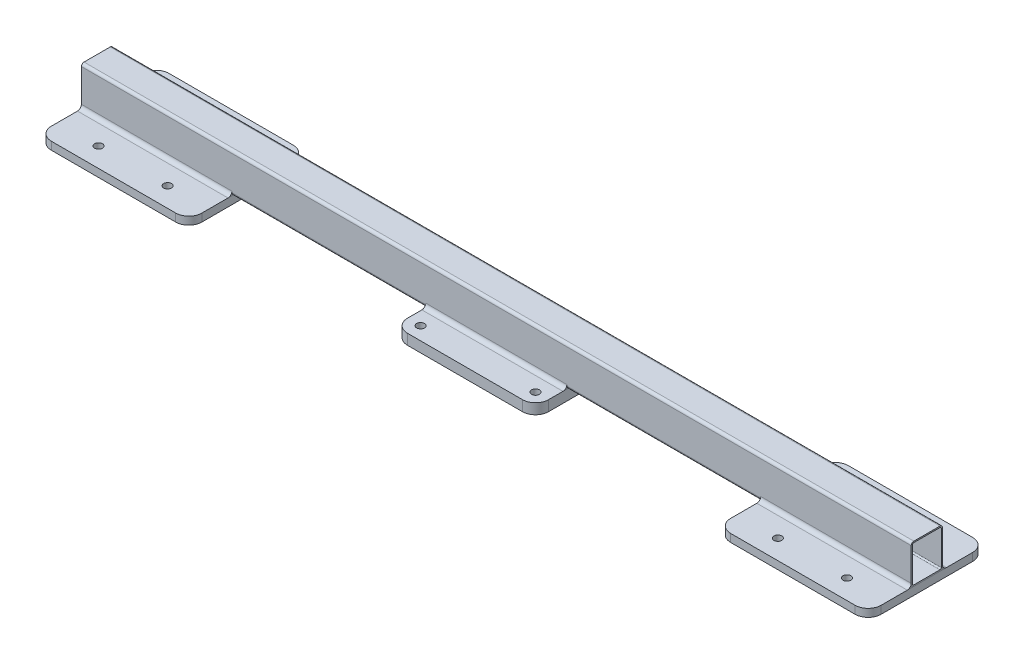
from build123d import *

# Parameters (mm, degrees)
SKETCH2_W                           = 1588
SKETCH2_H                           = 60
EXTRUDE1_DEPTH                      = 75
FILLET1_R                           = 5
SHELL1_T                            = -2.5
SKETCH2_3_R                         = 7.5
SKETCH2_3_W                         = 288
SKETCH2_3_H                         = 60
EXTRUDE2_DEPTH                      = 15
SKETCH2_4_W                         = 270
SKETCH2_4_H                         = 180
EXTRUDE3_DEPTH                      = 20
EXTRUDE4_DEPTH                      = 288
EXTRUDE5_REACH                      = 807.43
EXTRUDE5_DIRECTION_2_REACH          = 807.43
FILLET9_R                           = 2
FILLET10_R                          = 2
FILLET11_R                          = 25
SKETCH7_W                           = 7.5
SKETCH7_H                           = 20
F_15_0_15_DIAMETER_HOLE1_AT_2_COUNT = 2
F_15_0_15_DIAMETER_HOLE1_AT_2_PITCH = 130
F_15_0_15_DIAMETER_HOLE1_AT_3_COUNT = 2
F_15_0_15_DIAMETER_HOLE1_AT_3_PITCH = 255.538646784
F_15_0_15_DIAMETER_HOLE1_AT_4_COUNT = 2
F_15_0_15_DIAMETER_HOLE1_AT_4_PITCH = 220


with BuildPart() as part:
    # Sketch2 → Extrude1 (new body)
    with BuildSketch(Plane(origin=(0, 0, 0), x_dir=(1, 0, 0), z_dir=(0, 1, 0))):
        Rectangle(SKETCH2_W, SKETCH2_H)
    extrude(amount=EXTRUDE1_DEPTH)

    # Fillet1
    fillet1_edges = [part.edges().sort_by_distance(p)[0] for p in [
        (0, 75, -30),
        (0, 75, 30),
        (0, 0, -30),
        (0, 0, 30),
    ]]
    fillet(fillet1_edges, radius=FILLET1_R)

    # Shell1
    shell1_openings = [part.faces().sort_by_distance(p)[0] for p in [
        (-794, 37.5, 0),
        (794, 37.5, 0),
    ]]
    offset(amount=SHELL1_T, openings=shell1_openings, kind=Kind.INTERSECTION)


with BuildPart() as body_2:
    # Sketch2_3 → Extrude2 (new body)
    # profile 1 of 6: a face of its own
    with BuildSketch(Plane(origin=(0, 0, 0), x_dir=(1, 0, 0), z_dir=(0, 1, 0))):
        with BuildLine():
            Line((-794, 30), (-506, 30))
            Line((-506, 30), (-506, 87.5))
            ThreePointArc((-506, 87.5), (-513.32233047, 105.17766953), (-531, 112.5))
            Line((-531, 112.5), (-769, 112.5))
            ThreePointArc((-769, 112.5), (-786.67766953, 105.17766953), (-794, 87.5))
            Line((-794, 87.5), (-794, 30))
        make_face()
        with Locations(Location((-715.998314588, 75.128040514, 0), (0, 0, 270))):
            Circle(SKETCH2_3_R, mode=Mode.SUBTRACT)
        with Locations(Location((-584.001685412, 75.128040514, 0), (0, 0, 270))):
            Circle(SKETCH2_3_R, mode=Mode.SUBTRACT)
    # profile 2 of 6: a face of its own
    with BuildSketch(Plane(origin=(0, 0, 0), x_dir=(1, 0, 0), z_dir=(0, 1, 0))):
        with Locations((-650, 0)):
            Rectangle(SKETCH2_3_W, SKETCH2_3_H)
    # profile 3 of 6: a face of its own
    with BuildSketch(Plane(origin=(0, 0, 0), x_dir=(1, 0, 0), z_dir=(0, 1, 0))):
        with BuildLine():
            Line((-506, -87.5), (-506, -30))
            Line((-506, -30), (-794, -30))
            Line((-794, -30), (-794, -87.5))
            ThreePointArc((-794, -87.5), (-786.67766953, -105.17766953), (-769, -112.5))
            Line((-769, -112.5), (-531, -112.5))
            ThreePointArc((-531, -112.5), (-513.32233047, -105.17766953), (-506, -87.5))
        make_face()
        with Locations(Location((-715.998314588, -75.128040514, 0), (0, 0, 270))):
            Circle(SKETCH2_3_R, mode=Mode.SUBTRACT)
        with Locations(Location((-584.001685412, -75.128040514, 0), (0, 0, 270))):
            Circle(SKETCH2_3_R, mode=Mode.SUBTRACT)
    # profile 4 of 6: a face of its own
    with BuildSketch(Plane(origin=(0, 0, 0), x_dir=(1, 0, 0), z_dir=(0, 1, 0))):
        with BuildLine():
            Line((506, 87.5), (506, 30))
            Line((506, 30), (794, 30))
            Line((794, 30), (794, 87.5))
            ThreePointArc((794, 87.5), (786.67766953, 105.17766953), (769, 112.5))
            Line((769, 112.5), (531, 112.5))
            ThreePointArc((531, 112.5), (513.32233047, 105.17766953), (506, 87.5))
        make_face()
        with Locations(Location((584.001685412, 75.128040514, 0), (0, 0, 270))):
            Circle(SKETCH2_3_R, mode=Mode.SUBTRACT)
        with Locations(Location((715.998314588, 75.128040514, 0), (0, 0, 270))):
            Circle(SKETCH2_3_R, mode=Mode.SUBTRACT)
    # profile 5 of 6: a face of its own
    with BuildSketch(Plane(origin=(0, 0, 0), x_dir=(1, 0, 0), z_dir=(0, 1, 0))):
        with Locations((650, 0)):
            Rectangle(SKETCH2_3_W, SKETCH2_3_H)
    # profile 6 of 6: a face of its own
    with BuildSketch(Plane(origin=(0, 0, 0), x_dir=(1, 0, 0), z_dir=(0, 1, 0))):
        with BuildLine():
            ThreePointArc((506, -87.5), (513.32233047, -105.17766953), (531, -112.5))
            Line((531, -112.5), (769, -112.5))
            ThreePointArc((769, -112.5), (786.67766953, -105.17766953), (794, -87.5))
            Line((794, -87.5), (794, -30))
            Line((794, -30), (506, -30))
            Line((506, -30), (506, -87.5))
        make_face()
        with Locations(Location((584.001685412, -75.128040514, 0), (0, 0, 270))):
            Circle(SKETCH2_3_R, mode=Mode.SUBTRACT)
        with Locations(Location((715.998314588, -75.128040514, 0), (0, 0, 270))):
            Circle(SKETCH2_3_R, mode=Mode.SUBTRACT)
    extrude(amount=-EXTRUDE2_DEPTH)

    # Fillet9
    fillet9_edges = [body_2.edges().sort_by_distance(p)[0] for p in [
        (-584.001685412, -15, -82.628040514),
        (-715.998314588, -15, -82.628040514),
        (-715.998314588, -15, 67.628040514),
        (-584.001685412, -15, 67.628040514),
    ]]
    fillet(fillet9_edges, radius=FILLET9_R)

    # Fillet10
    fillet10_edges = [body_2.edges().sort_by_distance(p)[0] for p in [
        (584.001685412, -15, -82.628040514),
        (715.998314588, -15, -82.628040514),
        (584.001685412, -15, 67.628040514),
        (715.998314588, -15, 67.628040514),
    ]]
    fillet(fillet10_edges, radius=FILLET10_R)


with BuildPart() as body_3:
    # Sketch2_4 → Extrude3 (new body)
    with BuildSketch(Plane(origin=(0, 0, 0), x_dir=(1, 0, 0), z_dir=(0, 1, 0))):
        Rectangle(SKETCH2_4_W, SKETCH2_4_H)
    extrude(amount=-EXTRUDE3_DEPTH)


with BuildPart() as body_4:
    # Sketch3 → Extrude4 (new body)
    with BuildSketch(Plane(origin=(794, 0, 0), x_dir=(0, 0, -1), z_dir=(1, 0, 0))):
        with BuildLine():
            Line((25, 0), (37.5, 0))
            ThreePointArc((37.5, 0), (32.196699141, 2.196699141), (30, 7.5))
            Line((30, 7.5), (30, 5))
            ThreePointArc((30, 5), (28.535533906, 1.464466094), (25, 0))
        make_face()
    extrude(amount=-EXTRUDE4_DEPTH)


with BuildPart() as body_5:
    # Mirror3: mirrored copy
    add(body_4.part.mirror(Plane.XY))


with BuildPart() as body_6:
    # Mirror4: mirrored copy
    add(body_4.part.mirror(Plane(origin=(0, 0, 0), x_dir=(0, 0, 1), z_dir=(1, 0, 0))))


with BuildPart() as body_7:
    # Mirror4 2: mirrored copy
    add(body_5.part.mirror(Plane(origin=(0, 0, 0), x_dir=(0, 0, 1), z_dir=(1, 0, 0))))


with BuildPart() as body_8:

    # Extrude5: up to this face of the body (flat: up to its plane)
    extrude5_end = Plane(body_3.part.faces().sort_by_distance((135, -10, 0))[0])
    # Sketch4 → Extrude5 (new, up to the picked face)
    with BuildSketch(Plane(origin=(0, 0, 0), x_dir=(0, 0, -1), z_dir=(1, 0, 0)), mode=Mode.PRIVATE) as extrude5_sk1:
        with BuildLine():
            Line((25, 0), (37.5, 0))
            ThreePointArc((37.5, 0), (32.196699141, 2.196699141), (30, 7.5))
            Line((30, 7.5), (30, 5))
            ThreePointArc((30, 5), (28.535533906, 1.464466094), (25, 0))
        make_face()
    extrude5_tool1 = split(extrude(extrude5_sk1.sketch, amount=EXTRUDE5_REACH, mode=Mode.PRIVATE), bisect_by=extrude5_end, keep=Keep.BOTH, mode=Mode.PRIVATE)
    add(extrude5_tool1.solids().sort_by(Axis((0, 1.503438, -30.816152), (1, 0, 0)))[0])


    # Extrude5 direction 2: up to this face of the body (flat: up to its plane)
    extrude5_direction_2_end = Plane(body_3.part.faces().sort_by_distance((-135, -10, 0))[0])
    # Sketch4 → Extrude5 direction 2 (add, up to the picked face)
    with BuildSketch(Plane(origin=(0, 0, 0), x_dir=(0, 0, -1), z_dir=(1, 0, 0)), mode=Mode.PRIVATE) as extrude5_direction_2_sk1:
        with BuildLine():
            Line((25, 0), (37.5, 0))
            ThreePointArc((37.5, 0), (32.196699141, 2.196699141), (30, 7.5))
            Line((30, 7.5), (30, 5))
            ThreePointArc((30, 5), (28.535533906, 1.464466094), (25, 0))
        make_face()
    extrude5_direction_2_tool1 = split(extrude(extrude5_direction_2_sk1.sketch, amount=-EXTRUDE5_DIRECTION_2_REACH, mode=Mode.PRIVATE), bisect_by=extrude5_direction_2_end, keep=Keep.BOTH, mode=Mode.PRIVATE)
    add(extrude5_direction_2_tool1.solids().sort_by(Axis((0, 1.503438, -30.816152), (-1, 0, 0)))[0])


with BuildPart() as body_9:
    # Mirror5: mirrored copy
    add(body_8.part.mirror(Plane.XY))


with BuildPart() as body_3_1:
    add(body_3.part)

    # Fillet11
    fillet11_edges = [body_3_1.edges().sort_by_distance(p)[0] for p in [
        (-135, -10, -90),
        (135, -10, -90),
        (135, -10, 90),
        (-135, -10, 90),
    ]]
    fillet(fillet11_edges, radius=FILLET11_R)

    # Sketch7 → 15.0 _15_ Diameter Hole1 (revolve, cut)
    with BuildSketch(Plane(origin=(110, 0, -65), x_dir=(0, 0, 1), z_dir=(1, 0, 0))):
        with Locations((3.75, 10)):
            Rectangle(SKETCH7_W, SKETCH7_H)
    f_15_0_15_diameter_hole1 = revolve(axis=Axis((110, 6.35, -65), (0, -1, 0)), mode=Mode.SUBTRACT)

    # 15.0 _15_ Diameter Hole1 at 2: 15.0 _15_ Diameter Hole1 ×2
    with Locations(*[(0, 0, i * F_15_0_15_DIAMETER_HOLE1_AT_2_PITCH) for i in range(1, F_15_0_15_DIAMETER_HOLE1_AT_2_COUNT)]):
        add(f_15_0_15_diameter_hole1, mode=Mode.SUBTRACT)

    # 15.0 _15_ Diameter Hole1 at 3: 15.0 _15_ Diameter Hole1 ×2
    with Locations(*[Vector(-0.8609265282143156, 0, 0.5087293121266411) * (i * F_15_0_15_DIAMETER_HOLE1_AT_3_PITCH) for i in range(1, F_15_0_15_DIAMETER_HOLE1_AT_3_COUNT)]):
        add(f_15_0_15_diameter_hole1, mode=Mode.SUBTRACT)

    # 15.0 _15_ Diameter Hole1 at 4: 15.0 _15_ Diameter Hole1 ×2
    with Locations(*[(-i * F_15_0_15_DIAMETER_HOLE1_AT_4_PITCH, 0, 0) for i in range(1, F_15_0_15_DIAMETER_HOLE1_AT_4_COUNT)]):
        add(f_15_0_15_diameter_hole1, mode=Mode.SUBTRACT)


solid = Compound([part.part, body_2.part, body_4.part, body_5.part, body_6.part, body_7.part, body_8.part, body_9.part, body_3_1.part])
